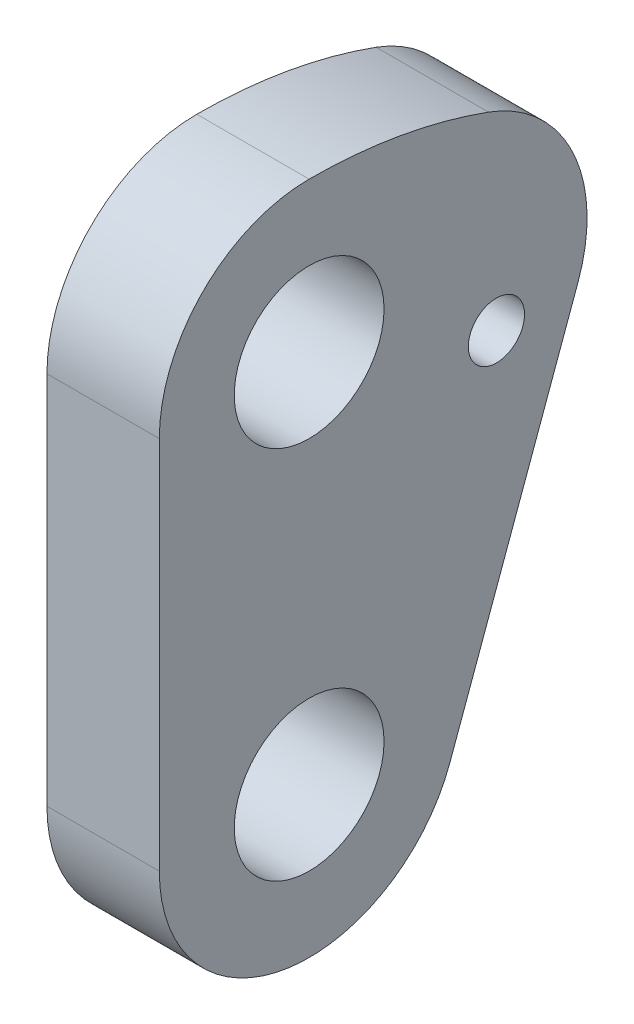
from build123d import *

# Parameters (mm, degrees)
SKETCH1_R           = 2
BOSS_EXTRUDE1_DEPTH = 3
SKETCH2_R           = 0.75
CUT_EXTRUDE1_DEPTH  = 17.126356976


with BuildPart() as part:
    # Sketch1 → Boss-Extrude1 (new body)
    with BuildSketch(Plane(origin=(0, 0, 0), x_dir=(0, 0, -1), z_dir=(1, 0, 0))):
        with BuildLine():
            Line((-4, 10), (-4, 0))
            ThreePointArc((-4, 0), (-0.694592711, -3.939231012), (3.758770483, -1.368080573))
            Line((3.758770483, -1.368080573), (7.178971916, 8.028845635))
            ThreePointArc((7.178971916, 8.028845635), (7.045432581, 11.087399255), (4.788282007, 13.155696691))
            ThreePointArc((4.788282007, 13.155696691), (2.431074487, 13.787308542), (0, 14))
            ThreePointArc((0, 14), (-2.828427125, 12.828427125), (-4, 10))
        make_face()
        Circle(SKETCH1_R, mode=Mode.SUBTRACT)
        with Locations((0, 10)):
            Circle(SKETCH1_R, mode=Mode.SUBTRACT)
    extrude(amount=BOSS_EXTRUDE1_DEPTH)

    # Sketch2 → Cut-Extrude1 (cut, through all)
    with BuildSketch(Plane(origin=(3, 0, 0), x_dir=(0, 0, -1), z_dir=(1, 0, 0))):
        with Locations((5, 8)):
            Circle(SKETCH2_R)
    extrude(amount=-CUT_EXTRUDE1_DEPTH, mode=Mode.SUBTRACT)


solid = part.part
